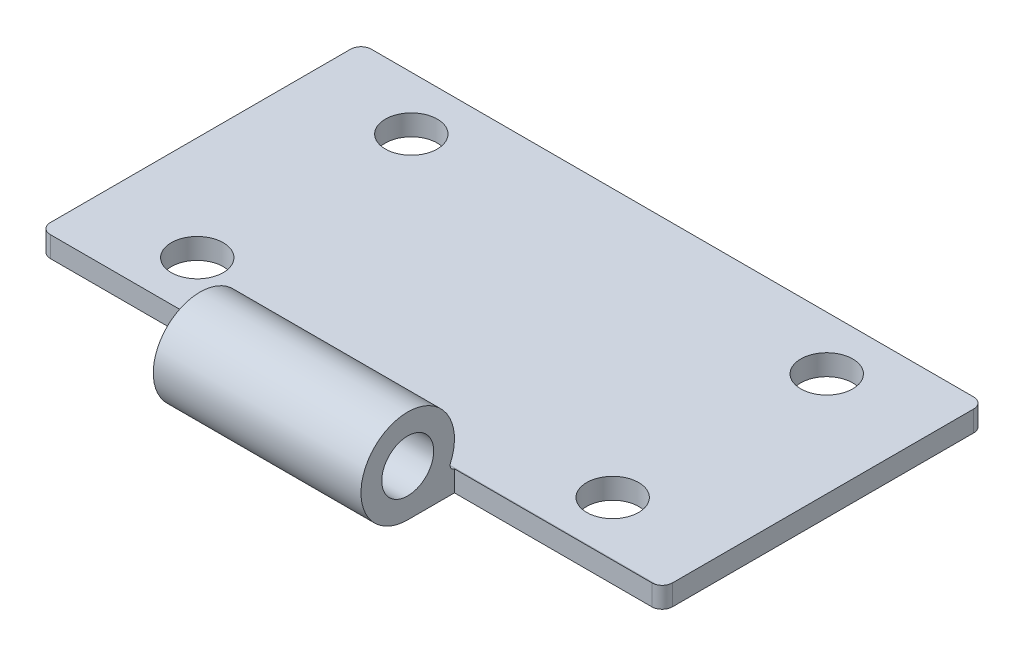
from build123d import *

# Parameters (mm, degrees)
SKETCH1_R           = 2.5
BOSS_EXTRUDE1_DEPTH = 60
SKETCH2_W           = 20
SKETCH2_H           = 9.082575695
SKETCH2_H_2         = 9
CUT_EXTRUDE1_DEPTH  = 60
SKETCH3_R           = 2.5
CUT_EXTRUDE2_DEPTH  = 60
FILLET1_R           = 1


with BuildPart() as part:
    # Sketch1 → Boss-Extrude1 (new body)
    with BuildSketch(Plane(origin=(0, 0, 0), x_dir=(0, 0, -1), z_dir=(1, 0, 0))):
        with BuildLine():
            Line((248.805037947, 0), (213.305037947, 0))
            ThreePointArc((213.305037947, 0), (210.840286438, 8.264970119), (217.429356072, 2.7))
            ThreePointArc((217.429356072, 2.7), (217.469283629, 2.226138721), (217.887613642, 2))
            Line((217.887613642, 2), (248.805037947, 2))
            Line((248.805037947, 2), (248.805037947, 0))
        make_face()
        with Locations((213.305037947, 4.5)):
            Circle(SKETCH1_R, mode=Mode.SUBTRACT)
    extrude(amount=BOSS_EXTRUDE1_DEPTH)

    # Sketch2 → Cut-Extrude1 (cut)
    with BuildSketch(Plane(origin=(0, 0, 0), x_dir=(1, 0, 0), z_dir=(0, 1, 0))):
        with Locations((10, 213.346325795)):
            Rectangle(SKETCH2_W, SKETCH2_H)
        with Locations((50, 213.305037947)):
            Rectangle(SKETCH2_W, SKETCH2_H_2)
    extrude(amount=CUT_EXTRUDE1_DEPTH, mode=Mode.SUBTRACT)

    # Sketch3 → Cut-Extrude2 (cut)
    with BuildSketch(Plane(origin=(0, 2, 0), x_dir=(1, 0, 0), z_dir=(0, 1, 0))):
        with Locations(Location((10, 243.652133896, 0), (0, 0, 270))):
            Circle(SKETCH3_R)
        with Locations(Location((10, 223.040517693, 0), (0, 0, 270))):
            Circle(SKETCH3_R)
        with Locations(Location((50, 223.040517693, 0), (0, 0, 270))):
            Circle(SKETCH3_R)
        with Locations(Location((50, 243.652133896, 0), (0, 0, 270))):
            Circle(SKETCH3_R)
    extrude(amount=-CUT_EXTRUDE2_DEPTH, mode=Mode.SUBTRACT)

    # Fillet1
    fillet1_edges = [part.edges().sort_by_distance(p)[0] for p in [
        (0, 1, -217.887613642),
        (0, 1, -248.805037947),
        (60, 1, -248.805037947),
        (60, 1.003432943, -217.805037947),
    ]]
    fillet(fillet1_edges, radius=FILLET1_R)


solid = part.part
